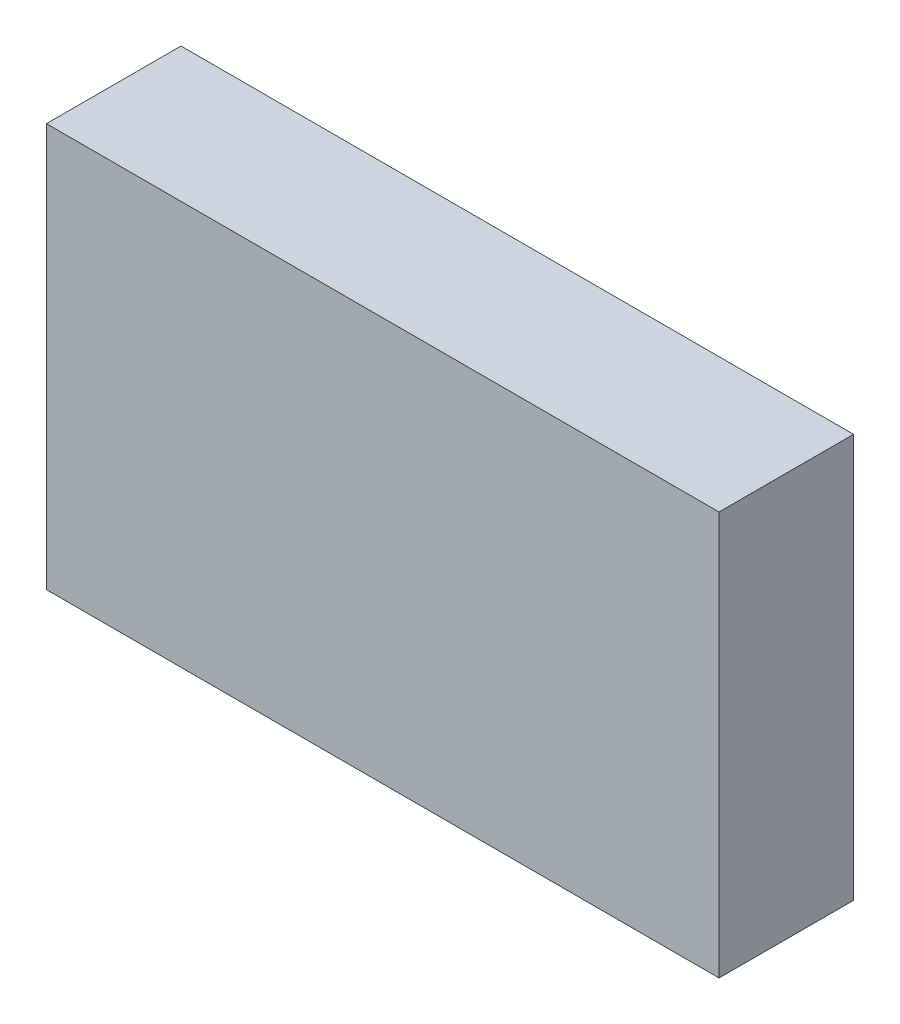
from build123d import *

# Parameters (mm, degrees)
SKETCH1_W            = 19.05
SKETCH1_H            = 6.35
PANEL_OR_BLOCK_DEPTH = 31.75


with BuildPart() as part:
    # Sketch1 → Panel_or_block (new body)
    with BuildSketch(Plane.YZ):
        with Locations((9.525, 3.175)):
            Rectangle(SKETCH1_W, SKETCH1_H)
    extrude(amount=PANEL_OR_BLOCK_DEPTH)


solid = part.part
